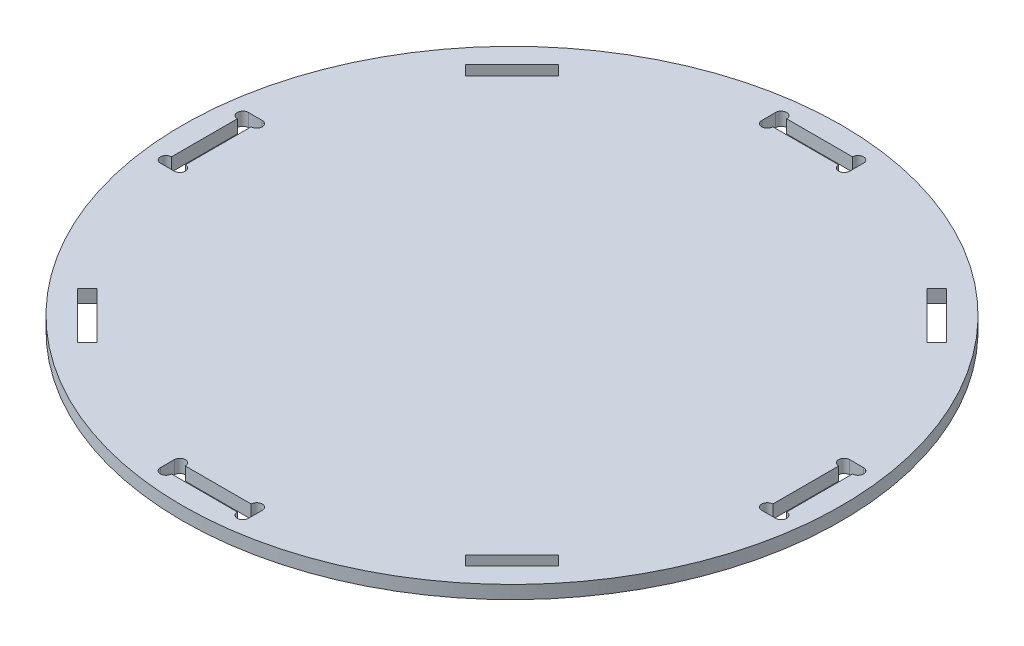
from build123d import *

# Parameters (mm, degrees)
SKETCH1_R           = 300
BOSS_EXTRUDE2_DEPTH = 12
CUT_EXTRUDE1_DEPTH  = 425.433740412
CUT_EXTRUDE2_DEPTH  = 425.433740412


with BuildPart() as part:
    # Sketch1 → Boss-Extrude2 (new body)
    with BuildSketch(Plane(origin=(0, 0, 0), x_dir=(1, 0, 0), z_dir=(0, 1, 0))):
        with Locations(Location((0, 0, 0), (0, 0, 270))):
            Circle(SKETCH1_R)
    extrude(amount=BOSS_EXTRUDE2_DEPTH)

    # Sketch3 → Cut-Extrude1 (cut, through all)
    with BuildSketch(Plane(origin=(0, 12, 0), x_dir=(1, 0, 0), z_dir=(0, 1, 0))):
        with BuildLine():
            Line((-30, 280), (30, 280))
            ThreePointArc((30, 280), (34.999806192, 285.044023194), (39.999612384, 280))
            Line((39.999612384, 280), (39.999612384, 267.4))
            ThreePointArc((39.999612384, 267.4), (34.999806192, 262.355976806), (30, 267.4))
            Line((30, 267.4), (-30, 267.4))
            ThreePointArc((-30, 267.4), (-34.999806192, 262.355976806), (-39.999612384, 267.4))
            Line((-39.999612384, 267.4), (-39.999612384, 280))
            ThreePointArc((-39.999612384, 280), (-34.999806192, 285.044023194), (-30, 280))
        make_face()
        with BuildLine():
            Line((280, 39.999612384), (267.4, 39.999612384))
            ThreePointArc((267.4, 39.999612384), (262.355976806, 34.999806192), (267.4, 30))
            Line((267.4, 30), (267.4, -30))
            ThreePointArc((267.4, -30), (262.355976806, -34.999806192), (267.4, -39.999612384))
            Line((267.4, -39.999612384), (280, -39.999612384))
            ThreePointArc((280, -39.999612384), (285.044023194, -34.999806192), (280, -30))
            Line((280, -30), (280, 30))
            ThreePointArc((280, 30), (285.044023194, 34.999806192), (280, 39.999612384))
        make_face()
        with BuildLine():
            Line((39.999612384, -280), (39.999612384, -267.4))
            ThreePointArc((39.999612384, -267.4), (34.999806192, -262.355976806), (30, -267.4))
            Line((30, -267.4), (-30, -267.4))
            ThreePointArc((-30, -267.4), (-34.999806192, -262.355976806), (-39.999612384, -267.4))
            Line((-39.999612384, -267.4), (-39.999612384, -280))
            ThreePointArc((-39.999612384, -280), (-34.999806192, -285.044023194), (-30, -280))
            Line((-30, -280), (30, -280))
            ThreePointArc((30, -280), (34.999806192, -285.044023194), (39.999612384, -280))
        make_face()
        with BuildLine():
            Line((-280, -39.999612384), (-267.4, -39.999612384))
            ThreePointArc((-267.4, -39.999612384), (-262.355976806, -34.999806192), (-267.4, -30))
            Line((-267.4, -30), (-267.4, 30))
            ThreePointArc((-267.4, 30), (-262.355976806, 34.999806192), (-267.4, 39.999612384))
            Line((-267.4, 39.999612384), (-280, 39.999612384))
            ThreePointArc((-280, 39.999612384), (-285.044023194, 34.999806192), (-280, 30))
            Line((-280, 30), (-280, -30))
            ThreePointArc((-280, -30), (-285.044023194, -34.999806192), (-280, -39.999612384))
        make_face()
    extrude(amount=-CUT_EXTRUDE1_DEPTH, mode=Mode.SUBTRACT)

    # Sketch4 → Cut-Extrude2 (cut, through all)
    with BuildSketch(Plane(origin=(0, 12, 0), x_dir=(1, 0, 0), z_dir=(0, 1, 0))):
        Polygon((-218.926438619, 176.500031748), (-176.500031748, 218.926438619), (-167.661196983, 210.087603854), (-210.087603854, 167.661196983), align=None)
        Polygon((176.500031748, 218.926438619), (218.926438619, 176.500031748), (210.087603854, 167.661196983), (167.661196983, 210.087603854), align=None)
        Polygon((218.926438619, -176.500031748), (176.500031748, -218.926438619), (167.661196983, -210.087603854), (210.087603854, -167.661196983), align=None)
        Polygon((-176.500031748, -218.926438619), (-218.926438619, -176.500031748), (-210.087603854, -167.661196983), (-167.661196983, -210.087603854), align=None)
    extrude(amount=-CUT_EXTRUDE2_DEPTH, mode=Mode.SUBTRACT)


solid = part.part
